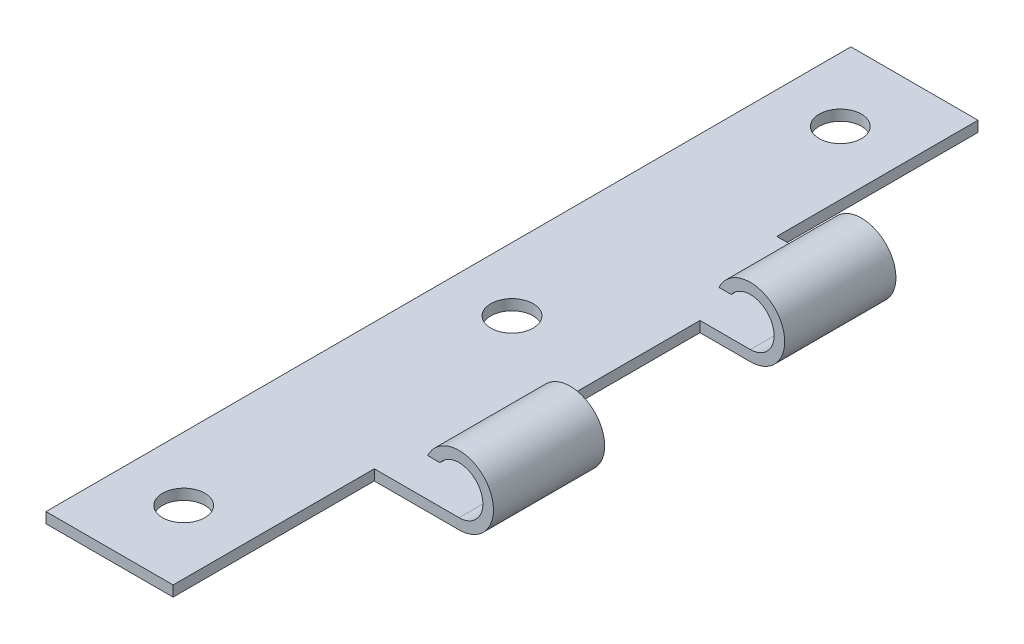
from build123d import *

# Parameters (mm, degrees)
SKETCH_1_R                  = 3.25
EXTRUDE_1_DEPTH             = 38
EXTRUDE_2_REACH             = 40.277
SKETCH_2_W                  = 20
SKETCH_2_H                  = 1
EXTRUDE_2_DIRECTION_2_REACH = 40.277
CUT_EXTRUDE_1_REACH         = 80.655
SKETCH_3_R                  = 2.25
CUT_EXTRUDE_2_REACH         = 80.655
SKETCH_4_W                  = 3.25
SKETCH_4_H                  = 3.6
SKETCH_5_W                  = 11.25
SKETCH_5_H                  = 19
SKETCH_5_W_2                = 8
SKETCH_5_H_2                = 17
CUT_EXTRUDE_3_DEPTH         = 44.430979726
HOLE_WIZARD_4_0_4_1_D       = 4


with BuildPart() as part:
    # Sketch 1 → Extrude 1 (new, symmetric)
    with BuildSketch(Plane.XY):
        Circle(SKETCH_1_R)
    extrude(amount=EXTRUDE_1_DEPTH, both=True)

    # Extrude 2: up to this face of the body (flat: up to its plane)
    extrude_2_end = Plane(part.part.faces().sort_by_distance((0, 0, 38))[0])
    # Sketch 2 → Extrude 2 (add, up to the picked face)
    with BuildSketch(Plane.XY, mode=Mode.PRIVATE) as extrude_2_sk1:
        with Locations((-10, -2.75)):
            Rectangle(SKETCH_2_W, SKETCH_2_H)
    extrude_2_tool1 = split(extrude(extrude_2_sk1.sketch, amount=EXTRUDE_2_REACH, mode=Mode.PRIVATE), bisect_by=extrude_2_end, keep=Keep.BOTH, mode=Mode.PRIVATE)
    add(extrude_2_tool1.solids().sort_by(Axis((-10, -2.75, 0), (0, 0, 1)))[0])

    # Extrude 2 direction 2: up to this face of the body (flat: up to its plane)
    extrude_2_direction_2_end = Plane(part.part.faces().sort_by_distance((0, 0, -38))[0])
    # Sketch 2 → Extrude 2 direction 2 (add, up to the picked face)
    with BuildSketch(Plane.XY, mode=Mode.PRIVATE) as extrude_2_direction_2_sk1:
        with Locations((-10, -2.75)):
            Rectangle(SKETCH_2_W, SKETCH_2_H)
    extrude_2_direction_2_tool1 = split(extrude(extrude_2_direction_2_sk1.sketch, amount=-EXTRUDE_2_DIRECTION_2_REACH, mode=Mode.PRIVATE), bisect_by=extrude_2_direction_2_end, keep=Keep.BOTH, mode=Mode.PRIVATE)
    add(extrude_2_direction_2_tool1.solids().sort_by(Axis((-10, -2.75, 0), (0, 0, -1)))[0])

    # Sketch 3 → Cut-Extrude 1 (cut, up to next)
    with BuildSketch(Plane.XY.offset(38), mode=Mode.PRIVATE) as cut_extrude_1_sk1:
        Circle(SKETCH_3_R)
    cut_extrude_1_tool1 = extrude(cut_extrude_1_sk1.sketch, amount=-CUT_EXTRUDE_1_REACH, mode=Mode.PRIVATE) & part.part
    add(cut_extrude_1_tool1.solids().sort_by_distance((0, 0, 38))[0], mode=Mode.SUBTRACT)

    # Sketch 4 → Cut-Extrude 2 (cut, up to next)
    with BuildSketch(Plane.XY.offset(38), mode=Mode.PRIVATE) as cut_extrude_2_sk1:
        with Locations((-1.625, -0.45)):
            Rectangle(SKETCH_4_W, SKETCH_4_H)
    cut_extrude_2_tool1 = extrude(cut_extrude_2_sk1.sketch, amount=-CUT_EXTRUDE_2_REACH, mode=Mode.PRIVATE) & part.part
    add(cut_extrude_2_tool1.solids().sort_by_distance((-1.625, -0.45, 38))[0], mode=Mode.SUBTRACT)

    # Sketch 5 → Cut-Extrude 3 (cut, through all)
    with BuildSketch(Plane.XZ.offset(3.25)):
        with Locations((-2.375, -28.5)):
            Rectangle(SKETCH_5_W, SKETCH_5_H)
        with Locations((-0.75, 0)):
            Rectangle(SKETCH_5_W_2, SKETCH_5_H_2)
        with Locations((-2.375, 28.5)):
            Rectangle(SKETCH_5_W, SKETCH_5_H)
    extrude(amount=-CUT_EXTRUDE_3_DEPTH, mode=Mode.SUBTRACT)

    # Hole Wizard 4.0 _4_ _1 (through all)
    with Locations(Plane(origin=(0, -2.25, 0), x_dir=(-1, 0, 0), z_dir=(0, 1, 0))):
        with Locations((14, -31), (14, 0), (14, 31)):
            Hole(HOLE_WIZARD_4_0_4_1_D / 2)


solid = part.part
